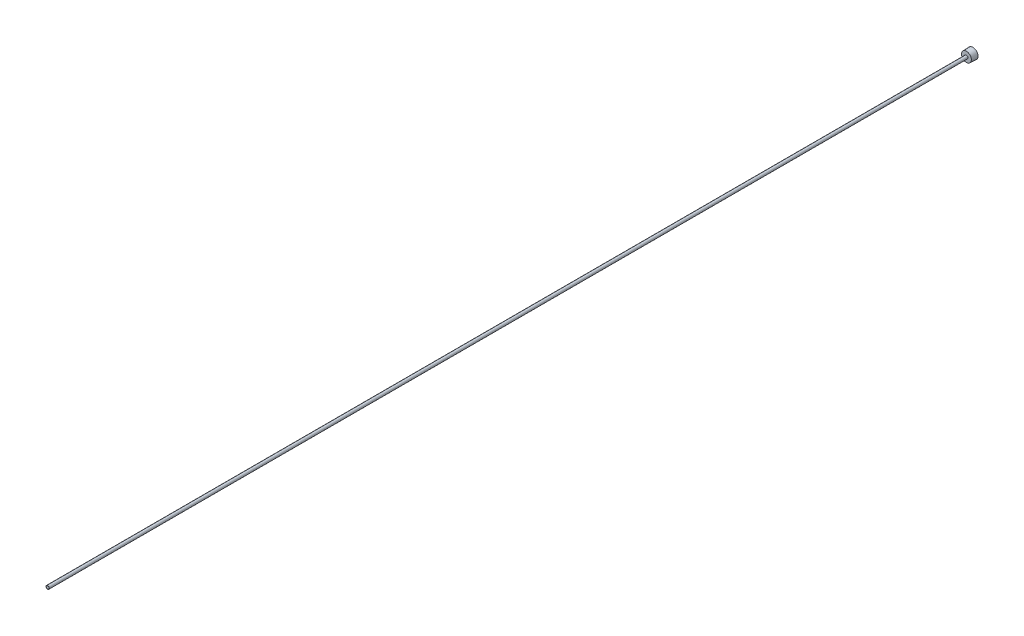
from build123d import *

# Parameters (mm, degrees)
SKETCH2_R          = 1.3843
CUT_EXTRUDE1_DEPTH = 915.42836307
CUT_EXTRUDE2_DEPTH = 4.7625


with BuildPart() as part:
    # Sketch1 → Revolve1 (revolve)
    with BuildSketch(Plane(origin=(0, 0, 0), x_dir=(0, 0, -1), z_dir=(1, 0, 0)), mode=Mode.PRIVATE) as revolve1_sk:
        Polygon((0, 0), (0, 5.0927), (-6.35, 4.861076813), (-6.35, 1.5875), (-914.4, 1.5875), (-914.4, 0), align=None)
    revolve(revolve1_sk.sketch.rotate(Axis((0, 0, 0), (0, 0, -1)), 180), axis=Axis((0, 0, 0), (0, 0, -1)))

    # Sketch2 → Cut-Extrude1 (cut, through all)
    with BuildSketch(Plane.XY.offset(914.4)):
        Circle(SKETCH2_R)
    extrude(amount=-CUT_EXTRUDE1_DEPTH, mode=Mode.SUBTRACT)

    # Sketch3 → Cut-Extrude2 (cut)
    with BuildSketch(Plane(origin=(0, 0, 0), x_dir=(-1, 0, 0), z_dir=(0, 0, -1))):
        Polygon((3.175, -1.833087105), (3.175, 1.833087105), (0, 3.666174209), (-3.175, 1.833087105), (-3.175, -1.833087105), (0, -3.666174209), align=None)
    extrude(amount=-CUT_EXTRUDE2_DEPTH, mode=Mode.SUBTRACT)


solid = part.part
